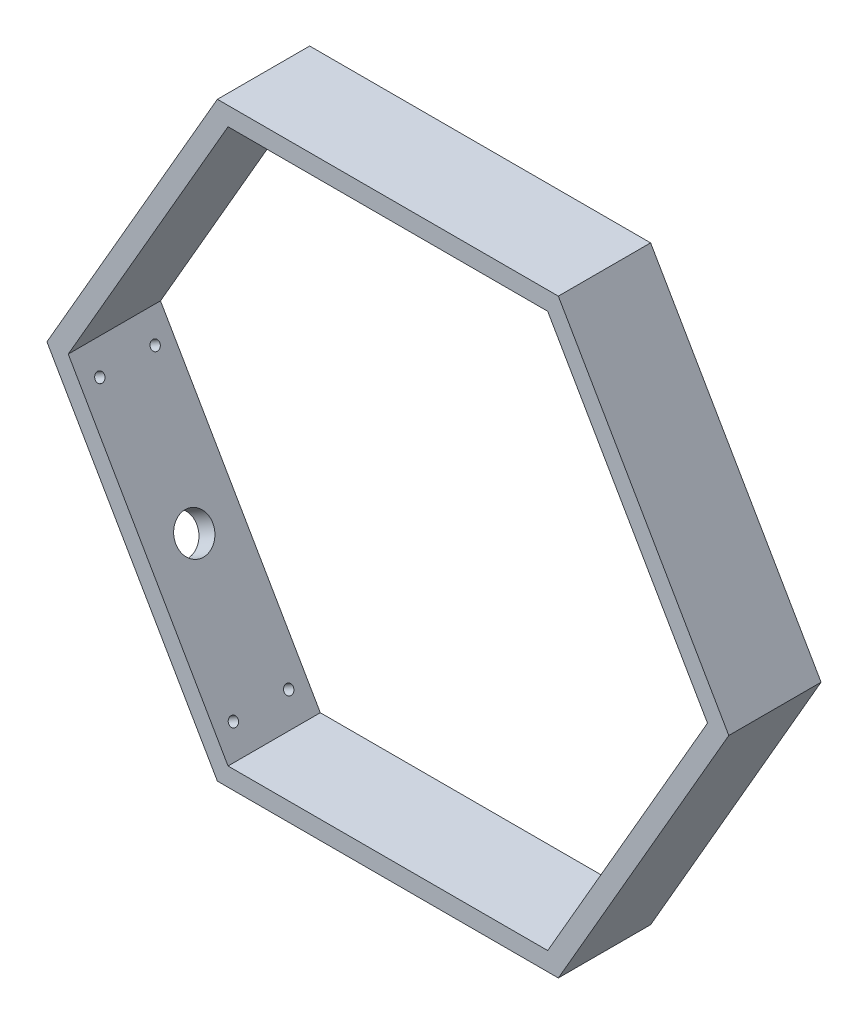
from build123d import *

# Parameters (mm, degrees)
BOSS_EXTRUDE1_DEPTH = 31.75
CUT_EXTRUDE1_REACH  = 259.651
SKETCH9_R           = 1.5875
SKETCH9_R_2         = 6.35


with BuildPart() as part:
    # Sketch1 → Boss-Extrude1 (new body)
    with BuildSketch(Plane.XY):
        Polygon((117.317574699, 0), (58.65878735, 101.6), (-58.65878735, 101.6), (-117.317574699, 0), (-58.65878735, -101.6), (58.65878735, -101.6), align=None)
        Polygon((54.99261314, 95.25), (-54.99261314, 95.25), (-109.985226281, 0), (-54.99261314, -95.25), (54.99261314, -95.25), (109.985226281, 0), align=None, mode=Mode.SUBTRACT)
    extrude(amount=BOSS_EXTRUDE1_DEPTH)

    # Sketch9 → Cut-Extrude1 (cut, up to next)
    with BuildSketch(Plane(origin=(-87.988181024, -50.8, 0), x_dir=(0, 0, 1), z_dir=(-0.8660254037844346, -0.5000000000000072, 0)), mode=Mode.PRIVATE) as cut_extrude1_sk1:
        with Locations(Location((6.35, 45.95878735, 0), (0, 0, 270))):
            Circle(SKETCH9_R)
    cut_extrude1_tool1 = extrude(cut_extrude1_sk1.sketch, amount=-CUT_EXTRUDE1_REACH, mode=Mode.PRIVATE) & part.part
    # Sketch9 → Cut-Extrude1 (cut, up to next)
    with BuildSketch(Plane(origin=(-87.988181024, -50.8, 0), x_dir=(0, 0, 1), z_dir=(-0.8660254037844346, -0.5000000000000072, 0)), mode=Mode.PRIVATE) as cut_extrude1_sk2:
        with Locations(Location((25.4, 45.95878735, 0), (0, 0, 270))):
            Circle(SKETCH9_R)
    cut_extrude1_tool2 = extrude(cut_extrude1_sk2.sketch, amount=-CUT_EXTRUDE1_REACH, mode=Mode.PRIVATE) & part.part
    # Sketch9 → Cut-Extrude1 (cut, up to next)
    with BuildSketch(Plane(origin=(-87.988181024, -50.8, 0), x_dir=(0, 0, 1), z_dir=(-0.8660254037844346, -0.5000000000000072, 0)), mode=Mode.PRIVATE) as cut_extrude1_sk3:
        with Locations(Location((6.35, -45.95878735, 0), (0, 0, 270))):
            Circle(SKETCH9_R)
    cut_extrude1_tool3 = extrude(cut_extrude1_sk3.sketch, amount=-CUT_EXTRUDE1_REACH, mode=Mode.PRIVATE) & part.part
    # Sketch9 → Cut-Extrude1 (cut, up to next)
    with BuildSketch(Plane(origin=(-87.988181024, -50.8, 0), x_dir=(0, 0, 1), z_dir=(-0.8660254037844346, -0.5000000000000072, 0)), mode=Mode.PRIVATE) as cut_extrude1_sk4:
        with Locations(Location((25.4, -45.95878735, 0), (0, 0, 270))):
            Circle(SKETCH9_R)
    cut_extrude1_tool4 = extrude(cut_extrude1_sk4.sketch, amount=-CUT_EXTRUDE1_REACH, mode=Mode.PRIVATE) & part.part
    # Sketch9 → Cut-Extrude1 (cut, up to next)
    with BuildSketch(Plane(origin=(-87.988181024, -50.8, 0), x_dir=(0, 0, 1), z_dir=(-0.8660254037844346, -0.5000000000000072, 0)), mode=Mode.PRIVATE) as cut_extrude1_sk5:
        with Locations(Location((15.875, 0, 0), (0, 0, 270))):
            Circle(SKETCH9_R_2)
    cut_extrude1_tool5 = extrude(cut_extrude1_sk5.sketch, amount=-CUT_EXTRUDE1_REACH, mode=Mode.PRIVATE) & part.part
    add(cut_extrude1_tool1.solids().sort_by_distance((-110.967575, -10.998523, 6.35))[0], mode=Mode.SUBTRACT)
    add(cut_extrude1_tool2.solids().sort_by_distance((-110.967575, -10.998523, 25.4))[0], mode=Mode.SUBTRACT)
    add(cut_extrude1_tool3.solids().sort_by_distance((-65.008787, -90.601477, 6.35))[0], mode=Mode.SUBTRACT)
    add(cut_extrude1_tool4.solids().sort_by_distance((-65.008787, -90.601477, 25.4))[0], mode=Mode.SUBTRACT)
    add(cut_extrude1_tool5.solids().sort_by_distance((-87.988181, -50.8, 15.875))[0], mode=Mode.SUBTRACT)


solid = part.part
